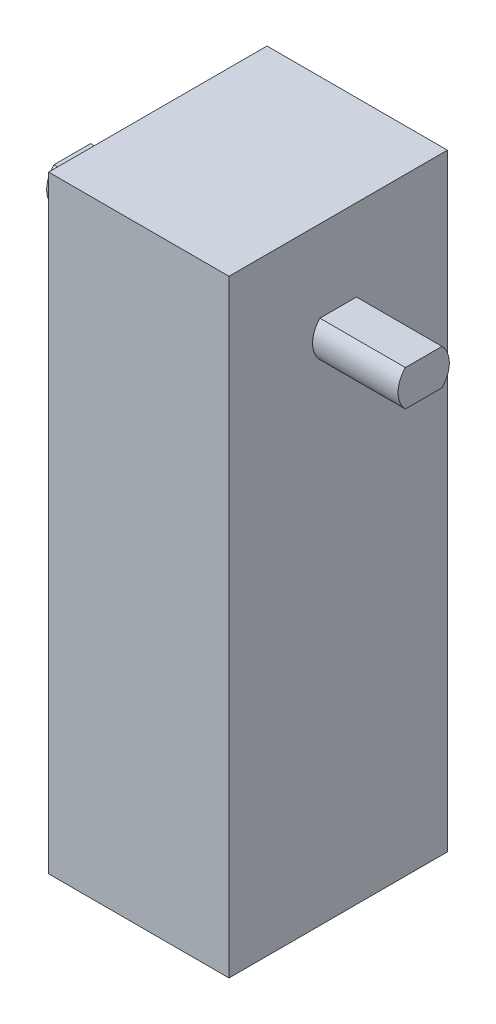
from build123d import *

# Parameters (mm, degrees)
CROQUIS1_W                   = 19
CROQUIS1_H                   = 64
SALIENTE_EXTRUIR1_DEPTH      = 23
SALIENTE_EXTRUIR2_DEPTH      = 9
SALIENTE_EXTRUIR3_DEPTH      = 9
SALIENTE_EXTRUIR3_DEPTH_BACK = 28


with BuildPart() as part:
    # Croquis1 → Saliente-Extruir1 (new body)
    with BuildSketch(Plane.XY):
        with Locations((-0.208050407, -4.910555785)):
            Rectangle(CROQUIS1_W, CROQUIS1_H)
    extrude(amount=SALIENTE_EXTRUIR1_DEPTH)

    # Croquis2 → Saliente-Extruir2 (add)
    with BuildSketch(Plane(origin=(9.291949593, 0, 0), x_dir=(0, 0, -1), z_dir=(1, 0, 0))):
        with BuildLine():
            Line((-13.428185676, 14.699444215), (-9.571814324, 14.699444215))
            ThreePointArc((-9.571814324, 14.699444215), (-8.8, 16.589444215), (-9.571814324, 18.479444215))
            Line((-9.571814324, 18.479444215), (-13.428185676, 18.479444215))
            ThreePointArc((-13.428185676, 18.479444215), (-14.2, 16.589444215), (-13.428185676, 14.699444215))
        make_face()
    extrude(amount=SALIENTE_EXTRUIR2_DEPTH)

    # Croquis2_2 → Saliente-Extruir3 (add, two sides: drawn at the far end of the back side and taken through both)
    with BuildSketch(Plane(origin=(9.291949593, 0, 0), x_dir=(0, 0, -1), z_dir=(1, 0, 0)).offset(-SALIENTE_EXTRUIR3_DEPTH_BACK)):
        with BuildLine():
            Line((-13.428185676, 14.699444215), (-9.571814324, 14.699444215))
            ThreePointArc((-9.571814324, 14.699444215), (-8.8, 16.589444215), (-9.571814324, 18.479444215))
            Line((-9.571814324, 18.479444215), (-13.428185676, 18.479444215))
            ThreePointArc((-13.428185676, 18.479444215), (-14.2, 16.589444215), (-13.428185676, 14.699444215))
        make_face()
    extrude(amount=SALIENTE_EXTRUIR3_DEPTH + SALIENTE_EXTRUIR3_DEPTH_BACK)


solid = part.part
